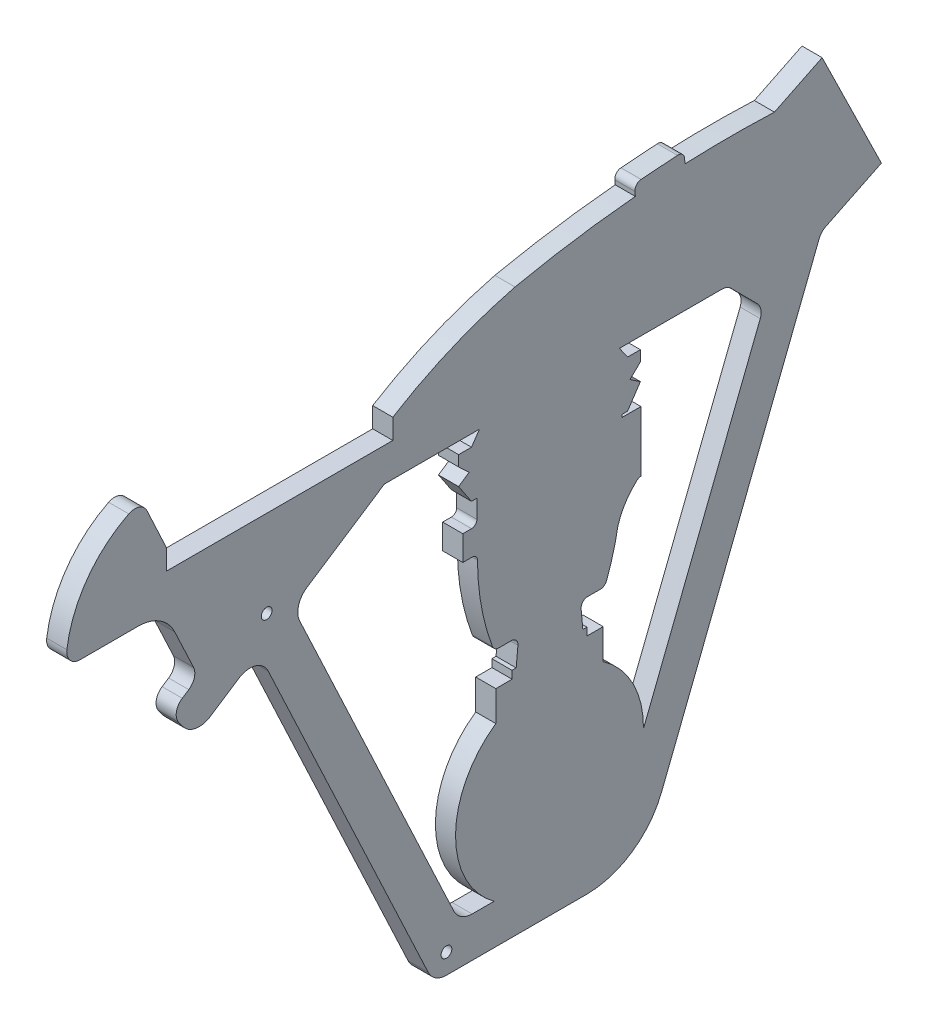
from build123d import *

# Parameters (mm, degrees)
SALIENTE_EXTRUIR1_DEPTH = 15
CORTAR_EXTRUIR2_START   = -77
CORTAR_EXTRUIR2_DEPTH   = 77
REDONDEO1_R             = 15
REDONDEO2_R             = 15
CROQUIS3_R              = 4
CORTAR_EXTRUIR3_DEPTH   = 15107.951841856
REDONDEO3_R             = 15
REDONDEO4_R             = 10
REDONDEO5_R             = 10
REDONDEO6_R             = 10
CROQUIS4_W              = 22.859676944
CROQUIS4_H              = 15
CORTAR_EXTRUIR4_DEPTH   = 15107.951841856
CORTAR_EXTRUIR5_DEPTH   = 15107.951841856
CROQUIS6_W              = 49.51507271
CROQUIS6_H              = 60.47841974
CORTAR_EXTRUIR6_DEPTH   = 15078.03974727
CROQUIS7_W              = 14
CROQUIS7_H              = 5
SALIENTE_EXTRUIR2_DEPTH = 15
CROQUIS8_R              = 4
CORTAR_EXTRUIR7_DEPTH   = 15078.03974727


with BuildPart() as part:
    # Croquis1 → Saliente-Extruir1 (new body)
    with BuildSketch(Plane(origin=(0, 0, 0), x_dir=(0, 0, -1), z_dir=(1, 0, 0))):
        with BuildLine():
            Line((13667.998329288, 5369.986943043), (13690.858006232, 5384.986943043))
            ThreePointArc((13690.858006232, 5384.986943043), (13734.895360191, 5407.702891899), (13781.863904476, 5423.490821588))
            ThreePointArc((13781.863904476, 5423.490821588), (13826.484237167, 5431.599080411), (13871.502863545, 5437.080068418))
            Line((13871.502863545, 5437.080068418), (13871.191909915, 5440.45591976))
            ThreePointArc((13871.191909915, 5440.45591976), (13872.356302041, 5444.147080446), (13875.806433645, 5445.901237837))
            Line((13875.806433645, 5445.901237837), (13902.910490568, 5447.881843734))
            ThreePointArc((13902.910490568, 5447.881843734), (13906.597706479, 5446.631299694), (13908.270043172, 5443.115234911))
            Line((13908.270043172, 5443.115234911), (13908.42525906, 5439.592538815))
            ThreePointArc((13908.42525906, 5439.592538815), (13941.776951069, 5440.342437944), (13975.129978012, 5439.654468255))
            Line((13975.129978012, 5439.654468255), (14037.582870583, 5470.246428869))
            Line((14037.582870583, 5470.246428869), (14081.767394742, 5380.0445822))
            Line((14081.767394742, 5380.0445822), (14013.390857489, 5346.692466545))
            ThreePointArc((14013.390857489, 5346.692466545), (14010.430495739, 5344.491448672), (14008.469570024, 5341.366870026))
            Line((14008.469570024, 5341.366870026), (13891.049038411, 5043.013702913))
            ThreePointArc((13891.049038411, 5043.013702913), (13868.993128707, 5015.396649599), (13835.217356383, 5004.986943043))
            Line((13835.217356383, 5004.986943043), (13754.449394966, 5004.986943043))
            Line((13754.449394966, 5004.986943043), (13721.308438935, 5004.986943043))
            Line((13721.308438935, 5004.986943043), (13667.677061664, 5119.236282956))
            ThreePointArc((13667.677061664, 5119.236282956), (13663.987028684, 5123.427719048), (13658.624818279, 5124.986943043))
            Line((13658.624818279, 5124.986943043), (13577.243753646, 5124.986943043))
            ThreePointArc((13577.243753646, 5124.986943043), (13564.639194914, 5205.238865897), (13524.921454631, 5276.103152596))
            Line((13524.921454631, 5276.103152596), (13546.109530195, 5290.006285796))
            Line((13546.109530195, 5290.006285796), (13528.398785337, 5327.734962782))
            ThreePointArc((13528.398785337, 5327.734962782), (13517.328686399, 5340.309271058), (13501.242055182, 5344.986943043))
            Line((13501.242055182, 5344.986943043), (13447.298107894, 5344.986943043))
            ThreePointArc((13447.298107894, 5344.986943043), (13462.795213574, 5393.919015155), (13503.635700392, 5425.008605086))
            Line((13503.635700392, 5425.008605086), (13522.298107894, 5384.986943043))
            Line((13522.298107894, 5384.986943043), (13522.298107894, 5369.986943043))
            Line((13522.298107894, 5369.986943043), (13524.91615479, 5369.986943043))
            Line((13524.91615479, 5369.986943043), (13667.998329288, 5369.986943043))
        make_face()
        with BuildLine():
            Line((13615.97728069, 5299.97000067), (13684.582131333, 5344.986943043))
            Line((13684.582131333, 5344.986943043), (13755.452202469, 5344.986943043))
            Line((13755.452202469, 5344.986943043), (13749.43607904, 5336.332556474))
            Line((13749.43607904, 5336.332556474), (13739.867096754, 5336.332556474))
            Line((13739.867096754, 5336.332556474), (13739.867096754, 5328.3852718))
            Line((13739.867096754, 5328.3852718), (13747.684017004, 5320.976787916))
            Line((13747.684017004, 5320.976787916), (13739.867096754, 5315.723507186))
            Line((13739.867096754, 5315.723507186), (13749.43607904, 5301.423107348))
            Line((13749.43607904, 5301.423107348), (13753.482261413, 5301.423107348))
            Line((13753.482261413, 5301.423107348), (13753.482261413, 5287.761484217))
            ThreePointArc((13753.482261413, 5287.761484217), (13752.310688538, 5284.933057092), (13749.482261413, 5283.761484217))
            Line((13749.482261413, 5283.761484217), (13743.001191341, 5283.761484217))
            Line((13743.001191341, 5283.761484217), (13743.001191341, 5265.172839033))
            Line((13743.001191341, 5265.172839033), (13749.920391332, 5265.172839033))
            ThreePointArc((13749.920391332, 5265.172839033), (13752.746083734, 5264.003998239), (13753.920383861, 5261.180570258))
            ThreePointArc((13753.920383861, 5261.180570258), (13756.765261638, 5230.049786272), (13765.089234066, 5199.917900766))
            ThreePointArc((13765.089234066, 5199.917900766), (13766.922892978, 5197.563750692), (13769.770954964, 5196.673317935))
            Line((13769.770954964, 5196.673317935), (13779.068081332, 5196.673317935))
            ThreePointArc((13779.068081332, 5196.673317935), (13782.765062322, 5195.039670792), (13784.046218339, 5191.206250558))
            Line((13784.046218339, 5191.206250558), (13782.743583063, 5177.322393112))
            Line((13782.743583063, 5177.322393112), (13779.701742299, 5177.258983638))
            Line((13779.701742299, 5177.258983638), (13779.701742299, 5171.525491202))
            Line((13779.701742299, 5171.525491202), (13767.577608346, 5171.525491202))
            Line((13767.577608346, 5171.525491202), (13767.577608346, 5148.971117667))
            ThreePointArc((13767.577608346, 5148.971117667), (13737.581967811, 5092.306712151), (13766.305431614, 5034.986943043))
            Line((13766.305431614, 5034.986943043), (13740.366676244, 5034.986943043))
            Line((13740.366676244, 5034.986943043), (13615.97728069, 5299.97000067))
        make_face(mode=Mode.SUBTRACT)
        with BuildLine():
            Line((13942.928822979, 5342.026476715), (13962.359319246, 5322.422286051))
            ThreePointArc((13962.359319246, 5322.422286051), (13965.051514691, 5317.398859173), (13964.562137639, 5311.72054569))
            Line((13964.562137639, 5311.72054569), (13877.572614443, 5090.689356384))
            ThreePointArc((13877.572614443, 5090.689356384), (13869.818400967, 5123.558032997), (13847.577608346, 5148.971117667))
            Line((13847.577608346, 5148.971117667), (13847.577608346, 5171.525491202))
            Line((13847.577608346, 5171.525491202), (13835.453474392, 5171.525491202))
            Line((13835.453474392, 5171.525491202), (13835.453474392, 5177.258983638))
            Line((13835.453474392, 5177.258983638), (13832.411633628, 5177.322393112))
            Line((13832.411633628, 5177.322393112), (13831.108998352, 5191.206250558))
            ThreePointArc((13831.108998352, 5191.206250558), (13832.390154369, 5195.039670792), (13836.08713536, 5196.673317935))
            Line((13836.08713536, 5196.673317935), (13845.384261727, 5196.673317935))
            ThreePointArc((13845.384261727, 5196.673317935), (13848.232323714, 5197.563750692), (13850.065982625, 5199.917900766))
            ThreePointArc((13850.065982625, 5199.917900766), (13855.047216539, 5215.333045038), (13858.585494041, 5231.141901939))
            ThreePointArc((13858.585494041, 5231.141901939), (13864.080621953, 5243.116257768), (13872.582986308, 5253.180622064))
            ThreePointArc((13872.582986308, 5253.180622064), (13874.137733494, 5254.134457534), (13875.931151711, 5254.467161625))
            Line((13875.931151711, 5254.467161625), (13890.326044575, 5254.467161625))
            ThreePointArc((13890.326044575, 5254.467161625), (13893.211004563, 5255.383412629), (13895.038625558, 5257.796359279))
            ThreePointArc((13895.038625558, 5257.796359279), (13897.906412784, 5274.467161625), (13895.038625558, 5291.137963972))
            ThreePointArc((13895.038625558, 5291.137963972), (13893.211004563, 5293.550910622), (13890.326044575, 5294.467161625))
            Line((13890.326044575, 5294.467161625), (13861.672955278, 5294.467161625))
            Line((13861.672955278, 5294.467161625), (13861.672955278, 5301.423107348))
            Line((13861.672955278, 5301.423107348), (13865.719137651, 5301.423107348))
            Line((13865.719137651, 5301.423107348), (13875.288119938, 5315.723507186))
            Line((13875.288119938, 5315.723507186), (13867.471199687, 5320.976787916))
            Line((13867.471199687, 5320.976787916), (13875.288119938, 5328.3852718))
            Line((13875.288119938, 5328.3852718), (13875.288119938, 5336.332556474))
            Line((13875.288119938, 5336.332556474), (13865.719137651, 5336.332556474))
            Line((13865.719137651, 5336.332556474), (13859.703014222, 5344.986943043))
            Line((13859.703014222, 5344.986943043), (13935.826361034, 5344.986943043))
            ThreePointArc((13935.826361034, 5344.986943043), (13939.673740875, 5344.217201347), (13942.928822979, 5342.026476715))
        make_face(mode=Mode.SUBTRACT)
    extrude(amount=SALIENTE_EXTRUIR1_DEPTH)

    # Croquis2 → Cortar-Extruir2 (cut)
    with BuildSketch(Plane(origin=(15, 0, 0), x_dir=(0, 0, -1), z_dir=(1, 0, 0)).offset(CORTAR_EXTRUIR2_START)):
        with BuildLine():
            Line((13667.677061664, 5119.236282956), (13590.640648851, 5283.344679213))
            Line((13590.640648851, 5283.344679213), (13542.442826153, 5251.718364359))
            ThreePointArc((13542.442826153, 5251.718364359), (13569.087800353, 5190.891231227), (13577.243753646, 5124.986943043))
            Line((13577.243753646, 5124.986943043), (13658.624818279, 5124.986943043))
            ThreePointArc((13658.624818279, 5124.986943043), (13663.987028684, 5123.427719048), (13667.677061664, 5119.236282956))
        make_face()
    extrude(amount=CORTAR_EXTRUIR2_DEPTH, mode=Mode.SUBTRACT)

    # Redondeo1
    redondeo1_edges = [part.edges().sort_by_distance(p)[0] for p in [
        (7.5, 5299.97000067, -13615.97728069),
        (7.5, 5034.986943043, -13740.366676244),
        (7.5, 5004.986943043, -13721.308438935),
    ]]
    fillet(redondeo1_edges, radius=REDONDEO1_R)

    # Redondeo2
    redondeo2_edges = [part.edges().sort_by_distance(p)[0] for p in [
        (7.5, 5283.344679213, -13590.640648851),
    ]]
    fillet(redondeo2_edges, radius=REDONDEO2_R)

    # Croquis3 → Cortar-Extruir3 (cut, through all)
    with BuildSketch(Plane(origin=(15, 0, 0), x_dir=(0, 0, -1), z_dir=(1, 0, 0))):
        with Locations((13730.83755759, 5019.986943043)):
            Circle(CROQUIS3_R)
    extrude(amount=-CORTAR_EXTRUIR3_DEPTH, mode=Mode.SUBTRACT)

    # Redondeo3
    redondeo3_edges = [part.edges().sort_by_distance(p)[0] for p in [
        (7.5, 5251.718364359, -13542.442826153),
    ]]
    fillet(redondeo3_edges, radius=REDONDEO3_R)

    # Redondeo4
    redondeo4_edges = [part.edges().sort_by_distance(p)[0] for p in [
        (7.5, 5276.103152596, -13524.921454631),
        (7.5, 5290.006285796, -13546.109530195),
    ]]
    fillet(redondeo4_edges, radius=REDONDEO4_R)

    # Redondeo5
    redondeo5_edges = [part.edges().sort_by_distance(p)[0] for p in [
        (7.5, 5344.986943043, -13447.298107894),
    ]]
    fillet(redondeo5_edges, radius=REDONDEO5_R)

    # Redondeo6
    redondeo6_edges = [part.edges().sort_by_distance(p)[0] for p in [
        (7.5, 5425.008605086, -13503.635700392),
    ]]
    fillet(redondeo6_edges, radius=REDONDEO6_R)

    # Croquis4 → Cortar-Extruir4 (cut, through all)
    with BuildSketch(Plane(origin=(15, 0, 0), x_dir=(0, 0, -1), z_dir=(1, 0, 0))):
        with Locations((13679.42816776, 5377.486943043)):
            Rectangle(CROQUIS4_W, CROQUIS4_H)
    extrude(amount=-CORTAR_EXTRUIR4_DEPTH, mode=Mode.SUBTRACT)

    # Croquis5 → Cortar-Extruir5 (cut, through all)
    with BuildSketch(Plane(origin=(15, 0, 0), x_dir=(0, 0, -1), z_dir=(1, 0, 0))):
        Polygon((14037.582870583, 5470.246428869), (14081.767394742, 5380.0445822), (14054.82598875, 5366.847588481), (14010.641464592, 5457.049435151), align=None)
    extrude(amount=-CORTAR_EXTRUIR5_DEPTH, mode=Mode.SUBTRACT)

    # Croquis6 → Cortar-Extruir6 (cut, through all)
    with BuildSketch(Plane(origin=(15, 0, 0), x_dir=(0, 0, -1), z_dir=(1, 0, 0))):
        with Locations((13900.430491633, 5264.227951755)):
            Rectangle(CROQUIS6_W, CROQUIS6_H)
    extrude(amount=-CORTAR_EXTRUIR6_DEPTH, mode=Mode.SUBTRACT)

    # Croquis7 → Saliente-Extruir2 (add)
    with BuildSketch(Plane(origin=(15, 0, 0), x_dir=(0, 0, -1), z_dir=(1, 0, 0))):
        with Locations((13868.672955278, 5296.967161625)):
            Rectangle(CROQUIS7_W, CROQUIS7_H)
    extrude(amount=-SALIENTE_EXTRUIR2_DEPTH)

    # Croquis8 → Cortar-Extruir7 (cut, through all)
    with BuildSketch(Plane(origin=(15, 0, 0), x_dir=(0, 0, -1), z_dir=(1, 0, 0))):
        with Locations((13596.870316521, 5305.373402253)):
            Circle(CROQUIS8_R)
    extrude(amount=-CORTAR_EXTRUIR7_DEPTH, mode=Mode.SUBTRACT)


solid = part.part
